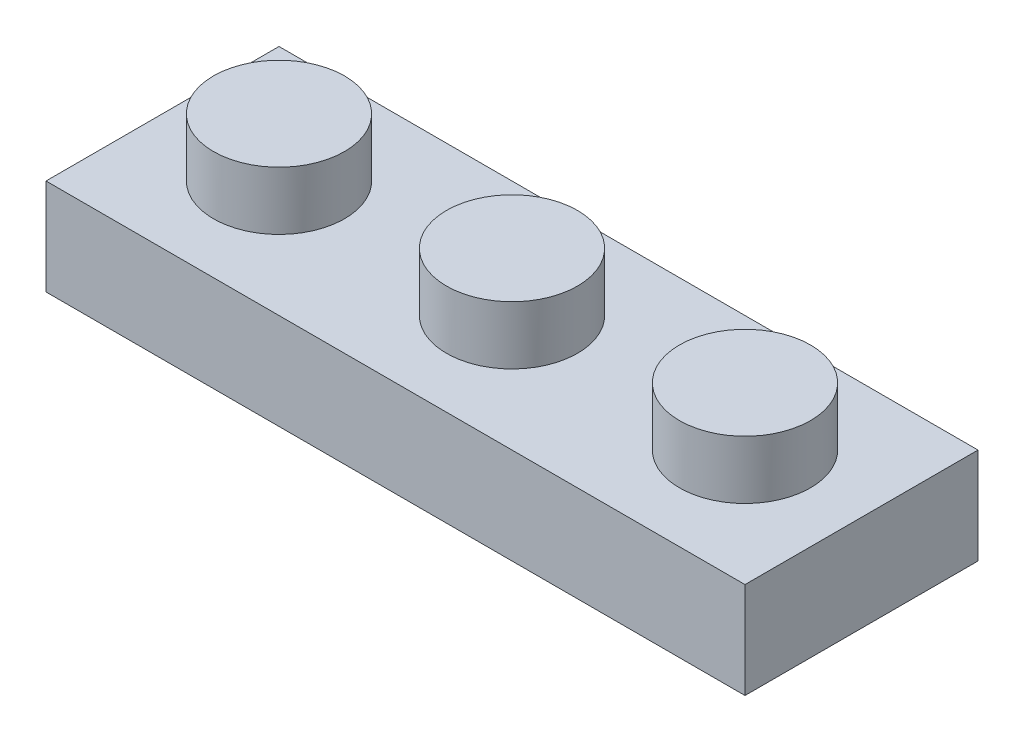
ISO-10303-21;
HEADER;
FILE_DESCRIPTION(('STEP AP214'),'2;1');
FILE_NAME('part.step','',(''),(''),'','','');
FILE_SCHEMA(('AUTOMOTIVE_DESIGN { 1 0 10303 214 1 1 1 1 }'));
ENDSEC;
DATA;
#1=APPLICATION_CONTEXT('core data for automotive mechanical design processes');
#2=APPLICATION_PROTOCOL_DEFINITION('international standard','automotive_design',2000,#1);
#3=PRODUCT_CONTEXT('',#1,'mechanical');
#4=PRODUCT('Part','Part','',(#3));
#5=PRODUCT_RELATED_PRODUCT_CATEGORY('part','',(#4));
#6=PRODUCT_DEFINITION_FORMATION('','',#4);
#7=PRODUCT_DEFINITION_CONTEXT('part definition',#1,'design');
#8=PRODUCT_DEFINITION('design','',#6,#7);
#9=PRODUCT_DEFINITION_SHAPE('','',#8);
#10=(LENGTH_UNIT() NAMED_UNIT(*) SI_UNIT(.MILLI.,.METRE.));
#11=(NAMED_UNIT(*) PLANE_ANGLE_UNIT() SI_UNIT($,.RADIAN.));
#12=(NAMED_UNIT(*) SI_UNIT($,.STERADIAN.) SOLID_ANGLE_UNIT());
#13=UNCERTAINTY_MEASURE_WITH_UNIT(LENGTH_MEASURE(1.E-05),#10,'distance_accuracy_value','');
#14=(GEOMETRIC_REPRESENTATION_CONTEXT(3) GLOBAL_UNCERTAINTY_ASSIGNED_CONTEXT((#13)) GLOBAL_UNIT_ASSIGNED_CONTEXT((#10,
#11,#12)) REPRESENTATION_CONTEXT('',''));
#15=CARTESIAN_POINT('',(0.,0.,0.));
#16=DIRECTION('',(0.,0.,1.));
#17=DIRECTION('',(1.,0.,0.));
#18=AXIS2_PLACEMENT_3D('',#15,#16,#17);
#19=CARTESIAN_POINT('',(0.,3.3,-8.));
#20=DIRECTION('',(0.,-1.,0.));
#21=DIRECTION('',(0.,0.,-1.));
#22=AXIS2_PLACEMENT_3D('',#19,#20,#21);
#23=PLANE('',#22);
#24=CARTESIAN_POINT('',(12.,3.3,-4.));
#25=DIRECTION('',(0.,-1.,0.));
#26=DIRECTION('',(0.,0.,-1.));
#27=AXIS2_PLACEMENT_3D('',#24,#25,#26);
#28=CIRCLE('',#27,2.25);
#29=CARTESIAN_POINT('',(12.,3.3,-6.25));
#30=VERTEX_POINT('',#29);
#31=EDGE_CURVE('E40',#30,#30,#28,.F.);
#32=ORIENTED_EDGE('',*,*,#31,.F.);
#33=EDGE_LOOP('',(#32));
#34=FACE_BOUND('',#33,.T.);
#35=DIRECTION('',(0.,0.,1.));
#36=VECTOR('',#35,1.);
#37=CARTESIAN_POINT('',(0.,3.3,0.));
#38=LINE('',#37,#36);
#39=CARTESIAN_POINT('',(0.,3.3,-8.));
#40=VERTEX_POINT('',#39);
#41=CARTESIAN_POINT('',(0.,3.3,0.));
#42=VERTEX_POINT('',#41);
#43=EDGE_CURVE('E250',#40,#42,#38,.T.);
#44=ORIENTED_EDGE('',*,*,#43,.T.);
#45=DIRECTION('',(1.,0.,0.));
#46=VECTOR('',#45,1.);
#47=CARTESIAN_POINT('',(0.,3.3,0.));
#48=LINE('',#47,#46);
#49=CARTESIAN_POINT('',(24.,3.3,0.));
#50=VERTEX_POINT('',#49);
#51=EDGE_CURVE('E253',#42,#50,#48,.T.);
#52=ORIENTED_EDGE('',*,*,#51,.T.);
#53=DIRECTION('',(0.,0.,-1.));
#54=VECTOR('',#53,1.);
#55=CARTESIAN_POINT('',(24.,3.3,0.));
#56=LINE('',#55,#54);
#57=CARTESIAN_POINT('',(24.,3.3,-8.));
#58=VERTEX_POINT('',#57);
#59=EDGE_CURVE('E256',#50,#58,#56,.T.);
#60=ORIENTED_EDGE('',*,*,#59,.T.);
#61=DIRECTION('',(-1.,0.,0.));
#62=VECTOR('',#61,1.);
#63=CARTESIAN_POINT('',(0.,3.3,-8.));
#64=LINE('',#63,#62);
#65=EDGE_CURVE('E258',#58,#40,#64,.T.);
#66=ORIENTED_EDGE('',*,*,#65,.T.);
#67=EDGE_LOOP('',(#44,#52,#60,#66));
#68=FACE_BOUND('',#67,.T.);
#69=CARTESIAN_POINT('',(4.,3.3,-4.));
#70=DIRECTION('',(0.,-1.,0.));
#71=DIRECTION('',(0.,0.,-1.));
#72=AXIS2_PLACEMENT_3D('',#69,#70,#71);
#73=CIRCLE('',#72,2.25);
#74=CARTESIAN_POINT('',(4.,3.3,-6.25));
#75=VERTEX_POINT('',#74);
#76=EDGE_CURVE('E279',#75,#75,#73,.F.);
#77=ORIENTED_EDGE('',*,*,#76,.F.);
#78=EDGE_LOOP('',(#77));
#79=FACE_BOUND('',#78,.T.);
#80=CARTESIAN_POINT('',(20.,3.3,-4.));
#81=DIRECTION('',(0.,-1.,0.));
#82=DIRECTION('',(0.,0.,-1.));
#83=AXIS2_PLACEMENT_3D('',#80,#81,#82);
#84=CIRCLE('',#83,2.25);
#85=CARTESIAN_POINT('',(20.,3.3,-6.25));
#86=VERTEX_POINT('',#85);
#87=EDGE_CURVE('E11',#86,#86,#84,.F.);
#88=ORIENTED_EDGE('',*,*,#87,.F.);
#89=EDGE_LOOP('',(#88));
#90=FACE_BOUND('',#89,.T.);
#91=ADVANCED_FACE('F32',(#34,#68,#79,#90),#23,.F.);
#92=CARTESIAN_POINT('',(0.,3.3,0.));
#93=DIRECTION('',(1.,0.,0.));
#94=DIRECTION('',(0.,0.,-1.));
#95=AXIS2_PLACEMENT_3D('',#92,#93,#94);
#96=PLANE('',#95);
#97=DIRECTION('',(0.,0.,1.));
#98=VECTOR('',#97,1.);
#99=CARTESIAN_POINT('',(0.,0.,0.));
#100=LINE('',#99,#98);
#101=CARTESIAN_POINT('',(0.,0.,-8.));
#102=VERTEX_POINT('',#101);
#103=CARTESIAN_POINT('',(0.,0.,0.));
#104=VERTEX_POINT('',#103);
#105=EDGE_CURVE('E249',#102,#104,#100,.T.);
#106=ORIENTED_EDGE('',*,*,#105,.T.);
#107=DIRECTION('',(0.,-1.,0.));
#108=VECTOR('',#107,1.);
#109=CARTESIAN_POINT('',(0.,3.3,0.));
#110=LINE('',#109,#108);
#111=EDGE_CURVE('E276',#42,#104,#110,.T.);
#112=ORIENTED_EDGE('',*,*,#111,.F.);
#113=ORIENTED_EDGE('',*,*,#43,.F.);
#114=DIRECTION('',(0.,-1.,0.));
#115=VECTOR('',#114,1.);
#116=CARTESIAN_POINT('',(0.,3.3,-8.));
#117=LINE('',#116,#115);
#118=EDGE_CURVE('E260',#40,#102,#117,.T.);
#119=ORIENTED_EDGE('',*,*,#118,.T.);
#120=EDGE_LOOP('',(#106,#112,#113,#119));
#121=FACE_BOUND('',#120,.T.);
#122=ADVANCED_FACE('F34',(#121),#96,.F.);
#123=CARTESIAN_POINT('',(0.,3.3,0.));
#124=DIRECTION('',(0.,0.,-1.));
#125=DIRECTION('',(-1.,0.,0.));
#126=AXIS2_PLACEMENT_3D('',#123,#124,#125);
#127=PLANE('',#126);
#128=DIRECTION('',(1.,0.,0.));
#129=VECTOR('',#128,1.);
#130=CARTESIAN_POINT('',(0.,0.,0.));
#131=LINE('',#130,#129);
#132=CARTESIAN_POINT('',(24.,0.,0.));
#133=VERTEX_POINT('',#132);
#134=EDGE_CURVE('E263',#104,#133,#131,.T.);
#135=ORIENTED_EDGE('',*,*,#134,.T.);
#136=DIRECTION('',(0.,-1.,0.));
#137=VECTOR('',#136,1.);
#138=CARTESIAN_POINT('',(24.,3.3,0.));
#139=LINE('',#138,#137);
#140=EDGE_CURVE('E273',#50,#133,#139,.T.);
#141=ORIENTED_EDGE('',*,*,#140,.F.);
#142=ORIENTED_EDGE('',*,*,#51,.F.);
#143=ORIENTED_EDGE('',*,*,#111,.T.);
#144=EDGE_LOOP('',(#135,#141,#142,#143));
#145=FACE_BOUND('',#144,.T.);
#146=ADVANCED_FACE('F385',(#145),#127,.F.);
#147=CARTESIAN_POINT('',(24.,3.3,0.));
#148=DIRECTION('',(-1.,0.,0.));
#149=DIRECTION('',(0.,0.,1.));
#150=AXIS2_PLACEMENT_3D('',#147,#148,#149);
#151=PLANE('',#150);
#152=DIRECTION('',(0.,0.,-1.));
#153=VECTOR('',#152,1.);
#154=CARTESIAN_POINT('',(24.,0.,0.));
#155=LINE('',#154,#153);
#156=CARTESIAN_POINT('',(24.,0.,-8.));
#157=VERTEX_POINT('',#156);
#158=EDGE_CURVE('E265',#133,#157,#155,.T.);
#159=ORIENTED_EDGE('',*,*,#158,.T.);
#160=DIRECTION('',(0.,-1.,0.));
#161=VECTOR('',#160,1.);
#162=CARTESIAN_POINT('',(24.,3.3,-8.));
#163=LINE('',#162,#161);
#164=EDGE_CURVE('E270',#58,#157,#163,.T.);
#165=ORIENTED_EDGE('',*,*,#164,.F.);
#166=ORIENTED_EDGE('',*,*,#59,.F.);
#167=ORIENTED_EDGE('',*,*,#140,.T.);
#168=EDGE_LOOP('',(#159,#165,#166,#167));
#169=FACE_BOUND('',#168,.T.);
#170=ADVANCED_FACE('F382',(#169),#151,.F.);
#171=CARTESIAN_POINT('',(0.,3.3,-8.));
#172=DIRECTION('',(0.,0.,1.));
#173=DIRECTION('',(1.,0.,0.));
#174=AXIS2_PLACEMENT_3D('',#171,#172,#173);
#175=PLANE('',#174);
#176=DIRECTION('',(-1.,0.,0.));
#177=VECTOR('',#176,1.);
#178=CARTESIAN_POINT('',(0.,0.,-8.));
#179=LINE('',#178,#177);
#180=EDGE_CURVE('E254',#157,#102,#179,.T.);
#181=ORIENTED_EDGE('',*,*,#180,.T.);
#182=ORIENTED_EDGE('',*,*,#118,.F.);
#183=ORIENTED_EDGE('',*,*,#65,.F.);
#184=ORIENTED_EDGE('',*,*,#164,.T.);
#185=EDGE_LOOP('',(#181,#182,#183,#184));
#186=FACE_BOUND('',#185,.T.);
#187=ADVANCED_FACE('F363',(#186),#175,.F.);
#188=CARTESIAN_POINT('',(0.,0.,-8.));
#189=DIRECTION('',(0.,-1.,0.));
#190=DIRECTION('',(0.,0.,-1.));
#191=AXIS2_PLACEMENT_3D('',#188,#189,#190);
#192=PLANE('',#191);
#193=DIRECTION('',(0.,0.,-1.));
#194=VECTOR('',#193,1.);
#195=CARTESIAN_POINT('',(1.75,0.,-1.75));
#196=LINE('',#195,#194);
#197=CARTESIAN_POINT('',(1.75,0.,-1.75));
#198=VERTEX_POINT('',#197);
#199=CARTESIAN_POINT('',(1.74999999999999,0.,-6.25));
#200=VERTEX_POINT('',#199);
#201=EDGE_CURVE('E47',#198,#200,#196,.T.);
#202=ORIENTED_EDGE('',*,*,#201,.F.);
#203=DIRECTION('',(-1.,0.,0.));
#204=VECTOR('',#203,1.);
#205=CARTESIAN_POINT('',(1.75,0.,-1.75));
#206=LINE('',#205,#204);
#207=CARTESIAN_POINT('',(6.25,0.,-1.75));
#208=VERTEX_POINT('',#207);
#209=EDGE_CURVE('E177',#208,#198,#206,.T.);
#210=ORIENTED_EDGE('',*,*,#209,.F.);
#211=DIRECTION('',(0.,0.,1.));
#212=VECTOR('',#211,1.);
#213=CARTESIAN_POINT('',(6.25,0.,-1.75));
#214=LINE('',#213,#212);
#215=CARTESIAN_POINT('',(6.25,0.,-6.25));
#216=VERTEX_POINT('',#215);
#217=EDGE_CURVE('E168',#216,#208,#214,.T.);
#218=ORIENTED_EDGE('',*,*,#217,.F.);
#219=DIRECTION('',(1.,0.,0.));
#220=VECTOR('',#219,1.);
#221=CARTESIAN_POINT('',(1.74999999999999,0.,-6.25));
#222=LINE('',#221,#220);
#223=EDGE_CURVE('E156',#200,#216,#222,.T.);
#224=ORIENTED_EDGE('',*,*,#223,.F.);
#225=EDGE_LOOP('',(#202,#210,#218,#224));
#226=FACE_BOUND('',#225,.T.);
#227=DIRECTION('',(0.,0.,-1.));
#228=VECTOR('',#227,1.);
#229=CARTESIAN_POINT('',(9.75,0.,-1.75));
#230=LINE('',#229,#228);
#231=CARTESIAN_POINT('',(9.75,0.,-1.75));
#232=VERTEX_POINT('',#231);
#233=CARTESIAN_POINT('',(9.74999999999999,0.,-6.25));
#234=VERTEX_POINT('',#233);
#235=EDGE_CURVE('E55',#232,#234,#230,.T.);
#236=ORIENTED_EDGE('',*,*,#235,.F.);
#237=DIRECTION('',(-1.,0.,0.));
#238=VECTOR('',#237,1.);
#239=CARTESIAN_POINT('',(9.75,0.,-1.75));
#240=LINE('',#239,#238);
#241=CARTESIAN_POINT('',(14.25,0.,-1.75));
#242=VERTEX_POINT('',#241);
#243=EDGE_CURVE('E203',#242,#232,#240,.T.);
#244=ORIENTED_EDGE('',*,*,#243,.F.);
#245=DIRECTION('',(0.,0.,1.));
#246=VECTOR('',#245,1.);
#247=CARTESIAN_POINT('',(14.25,0.,-1.75));
#248=LINE('',#247,#246);
#249=CARTESIAN_POINT('',(14.25,0.,-6.25));
#250=VERTEX_POINT('',#249);
#251=EDGE_CURVE('E198',#250,#242,#248,.T.);
#252=ORIENTED_EDGE('',*,*,#251,.F.);
#253=DIRECTION('',(1.,0.,0.));
#254=VECTOR('',#253,1.);
#255=CARTESIAN_POINT('',(9.74999999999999,0.,-6.25));
#256=LINE('',#255,#254);
#257=EDGE_CURVE('E182',#234,#250,#256,.T.);
#258=ORIENTED_EDGE('',*,*,#257,.F.);
#259=EDGE_LOOP('',(#236,#244,#252,#258));
#260=FACE_BOUND('',#259,.T.);
#261=DIRECTION('',(0.,0.,-1.));
#262=VECTOR('',#261,1.);
#263=CARTESIAN_POINT('',(17.75,0.,-1.75));
#264=LINE('',#263,#262);
#265=CARTESIAN_POINT('',(17.75,0.,-1.75));
#266=VERTEX_POINT('',#265);
#267=CARTESIAN_POINT('',(17.75,0.,-6.25));
#268=VERTEX_POINT('',#267);
#269=EDGE_CURVE('E214',#266,#268,#264,.T.);
#270=ORIENTED_EDGE('',*,*,#269,.F.);
#271=DIRECTION('',(-1.,0.,0.));
#272=VECTOR('',#271,1.);
#273=CARTESIAN_POINT('',(17.75,0.,-1.75));
#274=LINE('',#273,#272);
#275=CARTESIAN_POINT('',(22.25,0.,-1.75));
#276=VERTEX_POINT('',#275);
#277=EDGE_CURVE('E219',#276,#266,#274,.T.);
#278=ORIENTED_EDGE('',*,*,#277,.F.);
#279=DIRECTION('',(0.,0.,1.));
#280=VECTOR('',#279,1.);
#281=CARTESIAN_POINT('',(22.25,0.,-1.75));
#282=LINE('',#281,#280);
#283=CARTESIAN_POINT('',(22.25,0.,-6.25));
#284=VERTEX_POINT('',#283);
#285=EDGE_CURVE('E233',#284,#276,#282,.T.);
#286=ORIENTED_EDGE('',*,*,#285,.F.);
#287=DIRECTION('',(1.,0.,0.));
#288=VECTOR('',#287,1.);
#289=CARTESIAN_POINT('',(17.75,0.,-6.25));
#290=LINE('',#289,#288);
#291=EDGE_CURVE('E230',#268,#284,#290,.T.);
#292=ORIENTED_EDGE('',*,*,#291,.F.);
#293=EDGE_LOOP('',(#270,#278,#286,#292));
#294=FACE_BOUND('',#293,.T.);
#295=ORIENTED_EDGE('',*,*,#105,.F.);
#296=ORIENTED_EDGE('',*,*,#180,.F.);
#297=ORIENTED_EDGE('',*,*,#158,.F.);
#298=ORIENTED_EDGE('',*,*,#134,.F.);
#299=EDGE_LOOP('',(#295,#296,#297,#298));
#300=FACE_BOUND('',#299,.T.);
#301=ADVANCED_FACE('F357',(#226,#260,#294,#300),#192,.T.);
#302=CARTESIAN_POINT('',(4.,5.3,-4.));
#303=DIRECTION('',(0.,-1.,0.));
#304=DIRECTION('',(0.,0.,-1.));
#305=AXIS2_PLACEMENT_3D('',#302,#303,#304);
#306=CYLINDRICAL_SURFACE('',#305,2.25);
#307=CARTESIAN_POINT('',(4.,5.3,-4.));
#308=DIRECTION('',(0.,1.,0.));
#309=DIRECTION('',(0.,0.,1.));
#310=AXIS2_PLACEMENT_3D('',#307,#308,#309);
#311=CIRCLE('',#310,2.25);
#312=CARTESIAN_POINT('',(4.,5.3,-1.75));
#313=VERTEX_POINT('',#312);
#314=EDGE_CURVE('E240',#313,#313,#311,.T.);
#315=ORIENTED_EDGE('',*,*,#314,.F.);
#316=EDGE_LOOP('',(#315));
#317=FACE_BOUND('',#316,.T.);
#318=ORIENTED_EDGE('',*,*,#76,.T.);
#319=EDGE_LOOP('',(#318));
#320=FACE_BOUND('',#319,.T.);
#321=ADVANCED_FACE('F362',(#317,#320),#306,.T.);
#322=CARTESIAN_POINT('',(4.,5.3,-4.));
#323=DIRECTION('',(0.,1.,0.));
#324=DIRECTION('',(0.,0.,1.));
#325=AXIS2_PLACEMENT_3D('',#322,#323,#324);
#326=PLANE('',#325);
#327=ORIENTED_EDGE('',*,*,#314,.T.);
#328=EDGE_LOOP('',(#327));
#329=FACE_BOUND('',#328,.T.);
#330=ADVANCED_FACE('F397',(#329),#326,.T.);
#331=CARTESIAN_POINT('',(17.75,2.5,-1.75));
#332=DIRECTION('',(-1.,0.,0.));
#333=DIRECTION('',(0.,0.,1.));
#334=AXIS2_PLACEMENT_3D('',#331,#332,#333);
#335=PLANE('',#334);
#336=ORIENTED_EDGE('',*,*,#269,.T.);
#337=DIRECTION('',(0.,-1.,0.));
#338=VECTOR('',#337,1.);
#339=CARTESIAN_POINT('',(17.75,2.5,-6.25));
#340=LINE('',#339,#338);
#341=CARTESIAN_POINT('',(17.75,2.5,-6.25));
#342=VERTEX_POINT('',#341);
#343=EDGE_CURVE('E228',#342,#268,#340,.T.);
#344=ORIENTED_EDGE('',*,*,#343,.F.);
#345=DIRECTION('',(0.,0.,-1.));
#346=VECTOR('',#345,1.);
#347=CARTESIAN_POINT('',(17.75,2.5,-1.75));
#348=LINE('',#347,#346);
#349=CARTESIAN_POINT('',(17.75,2.5,-1.75));
#350=VERTEX_POINT('',#349);
#351=EDGE_CURVE('E215',#350,#342,#348,.T.);
#352=ORIENTED_EDGE('',*,*,#351,.F.);
#353=DIRECTION('',(0.,-1.,0.));
#354=VECTOR('',#353,1.);
#355=CARTESIAN_POINT('',(17.75,2.5,-1.75));
#356=LINE('',#355,#354);
#357=EDGE_CURVE('E238',#350,#266,#356,.T.);
#358=ORIENTED_EDGE('',*,*,#357,.T.);
#359=EDGE_LOOP('',(#336,#344,#352,#358));
#360=FACE_BOUND('',#359,.T.);
#361=ADVANCED_FACE('F401',(#360),#335,.F.);
#362=CARTESIAN_POINT('',(17.75,2.5,-1.75));
#363=DIRECTION('',(0.,0.,1.));
#364=DIRECTION('',(1.,0.,0.));
#365=AXIS2_PLACEMENT_3D('',#362,#363,#364);
#366=PLANE('',#365);
#367=ORIENTED_EDGE('',*,*,#277,.T.);
#368=ORIENTED_EDGE('',*,*,#357,.F.);
#369=DIRECTION('',(-1.,0.,0.));
#370=VECTOR('',#369,1.);
#371=CARTESIAN_POINT('',(17.75,2.5,-1.75));
#372=LINE('',#371,#370);
#373=CARTESIAN_POINT('',(22.25,2.5,-1.75));
#374=VERTEX_POINT('',#373);
#375=EDGE_CURVE('E225',#374,#350,#372,.T.);
#376=ORIENTED_EDGE('',*,*,#375,.F.);
#377=DIRECTION('',(0.,-1.,0.));
#378=VECTOR('',#377,1.);
#379=CARTESIAN_POINT('',(22.25,2.5,-1.75));
#380=LINE('',#379,#378);
#381=EDGE_CURVE('E241',#374,#276,#380,.T.);
#382=ORIENTED_EDGE('',*,*,#381,.T.);
#383=EDGE_LOOP('',(#367,#368,#376,#382));
#384=FACE_BOUND('',#383,.T.);
#385=ADVANCED_FACE('F405',(#384),#366,.F.);
#386=CARTESIAN_POINT('',(22.25,2.5,-1.75));
#387=DIRECTION('',(1.,0.,0.));
#388=DIRECTION('',(0.,0.,-1.));
#389=AXIS2_PLACEMENT_3D('',#386,#387,#388);
#390=PLANE('',#389);
#391=ORIENTED_EDGE('',*,*,#285,.T.);
#392=ORIENTED_EDGE('',*,*,#381,.F.);
#393=DIRECTION('',(0.,0.,1.));
#394=VECTOR('',#393,1.);
#395=CARTESIAN_POINT('',(22.25,2.5,-1.75));
#396=LINE('',#395,#394);
#397=CARTESIAN_POINT('',(22.25,2.5,-6.25));
#398=VERTEX_POINT('',#397);
#399=EDGE_CURVE('E222',#398,#374,#396,.T.);
#400=ORIENTED_EDGE('',*,*,#399,.F.);
#401=DIRECTION('',(0.,-1.,0.));
#402=VECTOR('',#401,1.);
#403=CARTESIAN_POINT('',(22.25,2.5,-6.25));
#404=LINE('',#403,#402);
#405=EDGE_CURVE('E243',#398,#284,#404,.T.);
#406=ORIENTED_EDGE('',*,*,#405,.T.);
#407=EDGE_LOOP('',(#391,#392,#400,#406));
#408=FACE_BOUND('',#407,.T.);
#409=ADVANCED_FACE('F410',(#408),#390,.F.);
#410=CARTESIAN_POINT('',(17.75,2.5,-6.25));
#411=DIRECTION('',(0.,0.,-1.));
#412=DIRECTION('',(-1.,0.,0.));
#413=AXIS2_PLACEMENT_3D('',#410,#411,#412);
#414=PLANE('',#413);
#415=ORIENTED_EDGE('',*,*,#291,.T.);
#416=ORIENTED_EDGE('',*,*,#405,.F.);
#417=DIRECTION('',(1.,0.,0.));
#418=VECTOR('',#417,1.);
#419=CARTESIAN_POINT('',(17.75,2.5,-6.25));
#420=LINE('',#419,#418);
#421=EDGE_CURVE('E218',#342,#398,#420,.T.);
#422=ORIENTED_EDGE('',*,*,#421,.F.);
#423=ORIENTED_EDGE('',*,*,#343,.T.);
#424=EDGE_LOOP('',(#415,#416,#422,#423));
#425=FACE_BOUND('',#424,.T.);
#426=ADVANCED_FACE('F407',(#425),#414,.F.);
#427=CARTESIAN_POINT('',(17.75,2.5,-6.25));
#428=DIRECTION('',(0.,-1.,0.));
#429=DIRECTION('',(0.,0.,-1.));
#430=AXIS2_PLACEMENT_3D('',#427,#428,#429);
#431=PLANE('',#430);
#432=ORIENTED_EDGE('',*,*,#351,.T.);
#433=ORIENTED_EDGE('',*,*,#421,.T.);
#434=ORIENTED_EDGE('',*,*,#399,.T.);
#435=ORIENTED_EDGE('',*,*,#375,.T.);
#436=EDGE_LOOP('',(#432,#433,#434,#435));
#437=FACE_BOUND('',#436,.T.);
#438=ADVANCED_FACE('F312',(#437),#431,.T.);
#439=CARTESIAN_POINT('',(12.,5.3,-4.));
#440=DIRECTION('',(0.,-1.,0.));
#441=DIRECTION('',(0.,0.,-1.));
#442=AXIS2_PLACEMENT_3D('',#439,#440,#441);
#443=CYLINDRICAL_SURFACE('',#442,2.25);
#444=CARTESIAN_POINT('',(12.,5.3,-4.));
#445=DIRECTION('',(0.,1.,0.));
#446=DIRECTION('',(0.,0.,1.));
#447=AXIS2_PLACEMENT_3D('',#444,#445,#446);
#448=CIRCLE('',#447,2.25);
#449=CARTESIAN_POINT('',(12.,5.3,-1.75));
#450=VERTEX_POINT('',#449);
#451=EDGE_CURVE('E211',#450,#450,#448,.T.);
#452=ORIENTED_EDGE('',*,*,#451,.F.);
#453=EDGE_LOOP('',(#452));
#454=FACE_BOUND('',#453,.T.);
#455=ORIENTED_EDGE('',*,*,#31,.T.);
#456=EDGE_LOOP('',(#455));
#457=FACE_BOUND('',#456,.T.);
#458=ADVANCED_FACE('F284',(#454,#457),#443,.T.);
#459=CARTESIAN_POINT('',(12.,5.3,-4.));
#460=DIRECTION('',(0.,1.,0.));
#461=DIRECTION('',(0.,0.,1.));
#462=AXIS2_PLACEMENT_3D('',#459,#460,#461);
#463=PLANE('',#462);
#464=ORIENTED_EDGE('',*,*,#451,.T.);
#465=EDGE_LOOP('',(#464));
#466=FACE_BOUND('',#465,.T.);
#467=ADVANCED_FACE('F299',(#466),#463,.T.);
#468=CARTESIAN_POINT('',(20.,5.3,-4.));
#469=DIRECTION('',(0.,-1.,0.));
#470=DIRECTION('',(0.,0.,-1.));
#471=AXIS2_PLACEMENT_3D('',#468,#469,#470);
#472=CYLINDRICAL_SURFACE('',#471,2.25);
#473=CARTESIAN_POINT('',(20.,5.3,-4.));
#474=DIRECTION('',(0.,1.,0.));
#475=DIRECTION('',(0.,0.,1.));
#476=AXIS2_PLACEMENT_3D('',#473,#474,#475);
#477=CIRCLE('',#476,2.25);
#478=CARTESIAN_POINT('',(20.,5.3,-1.75));
#479=VERTEX_POINT('',#478);
#480=EDGE_CURVE('E208',#479,#479,#477,.T.);
#481=ORIENTED_EDGE('',*,*,#480,.F.);
#482=EDGE_LOOP('',(#481));
#483=FACE_BOUND('',#482,.T.);
#484=ORIENTED_EDGE('',*,*,#87,.T.);
#485=EDGE_LOOP('',(#484));
#486=FACE_BOUND('',#485,.T.);
#487=ADVANCED_FACE('F296',(#483,#486),#472,.T.);
#488=CARTESIAN_POINT('',(20.,5.3,-4.));
#489=DIRECTION('',(0.,1.,0.));
#490=DIRECTION('',(0.,0.,1.));
#491=AXIS2_PLACEMENT_3D('',#488,#489,#490);
#492=PLANE('',#491);
#493=ORIENTED_EDGE('',*,*,#480,.T.);
#494=EDGE_LOOP('',(#493));
#495=FACE_BOUND('',#494,.T.);
#496=ADVANCED_FACE('F298',(#495),#492,.T.);
#497=CARTESIAN_POINT('',(9.75,2.5,-1.75));
#498=DIRECTION('',(-1.,0.,0.));
#499=DIRECTION('',(0.,0.,1.));
#500=AXIS2_PLACEMENT_3D('',#497,#498,#499);
#501=PLANE('',#500);
#502=ORIENTED_EDGE('',*,*,#235,.T.);
#503=DIRECTION('',(0.,-1.,0.));
#504=VECTOR('',#503,1.);
#505=CARTESIAN_POINT('',(9.74999999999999,2.5,-6.25));
#506=LINE('',#505,#504);
#507=CARTESIAN_POINT('',(9.74999999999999,2.5,-6.25));
#508=VERTEX_POINT('',#507);
#509=EDGE_CURVE('E196',#508,#234,#506,.T.);
#510=ORIENTED_EDGE('',*,*,#509,.F.);
#511=DIRECTION('',(0.,0.,-1.));
#512=VECTOR('',#511,1.);
#513=CARTESIAN_POINT('',(9.75,2.5,-1.75));
#514=LINE('',#513,#512);
#515=CARTESIAN_POINT('',(9.75,2.5,-1.75));
#516=VERTEX_POINT('',#515);
#517=EDGE_CURVE('E184',#516,#508,#514,.T.);
#518=ORIENTED_EDGE('',*,*,#517,.F.);
#519=DIRECTION('',(0.,-1.,0.));
#520=VECTOR('',#519,1.);
#521=CARTESIAN_POINT('',(9.75,2.5,-1.75));
#522=LINE('',#521,#520);
#523=EDGE_CURVE('E205',#516,#232,#522,.T.);
#524=ORIENTED_EDGE('',*,*,#523,.T.);
#525=EDGE_LOOP('',(#502,#510,#518,#524));
#526=FACE_BOUND('',#525,.T.);
#527=ADVANCED_FACE('F307',(#526),#501,.F.);
#528=CARTESIAN_POINT('',(9.75,2.5,-1.75));
#529=DIRECTION('',(0.,0.,1.));
#530=DIRECTION('',(1.,0.,0.));
#531=AXIS2_PLACEMENT_3D('',#528,#529,#530);
#532=PLANE('',#531);
#533=ORIENTED_EDGE('',*,*,#243,.T.);
#534=ORIENTED_EDGE('',*,*,#523,.F.);
#535=DIRECTION('',(-1.,0.,0.));
#536=VECTOR('',#535,1.);
#537=CARTESIAN_POINT('',(9.75,2.5,-1.75));
#538=LINE('',#537,#536);
#539=CARTESIAN_POINT('',(14.25,2.5,-1.75));
#540=VERTEX_POINT('',#539);
#541=EDGE_CURVE('E190',#540,#516,#538,.T.);
#542=ORIENTED_EDGE('',*,*,#541,.F.);
#543=DIRECTION('',(0.,-1.,0.));
#544=VECTOR('',#543,1.);
#545=CARTESIAN_POINT('',(14.25,2.5,-1.75));
#546=LINE('',#545,#544);
#547=EDGE_CURVE('E200',#540,#242,#546,.T.);
#548=ORIENTED_EDGE('',*,*,#547,.T.);
#549=EDGE_LOOP('',(#533,#534,#542,#548));
#550=FACE_BOUND('',#549,.T.);
#551=ADVANCED_FACE('F331',(#550),#532,.F.);
#552=CARTESIAN_POINT('',(14.25,2.5,-1.75));
#553=DIRECTION('',(1.,0.,0.));
#554=DIRECTION('',(0.,0.,-1.));
#555=AXIS2_PLACEMENT_3D('',#552,#553,#554);
#556=PLANE('',#555);
#557=ORIENTED_EDGE('',*,*,#251,.T.);
#558=ORIENTED_EDGE('',*,*,#547,.F.);
#559=DIRECTION('',(0.,0.,1.));
#560=VECTOR('',#559,1.);
#561=CARTESIAN_POINT('',(14.25,2.5,-1.75));
#562=LINE('',#561,#560);
#563=CARTESIAN_POINT('',(14.25,2.5,-6.25));
#564=VERTEX_POINT('',#563);
#565=EDGE_CURVE('E188',#564,#540,#562,.T.);
#566=ORIENTED_EDGE('',*,*,#565,.F.);
#567=DIRECTION('',(0.,-1.,0.));
#568=VECTOR('',#567,1.);
#569=CARTESIAN_POINT('',(14.25,2.5,-6.25));
#570=LINE('',#569,#568);
#571=EDGE_CURVE('E193',#564,#250,#570,.T.);
#572=ORIENTED_EDGE('',*,*,#571,.T.);
#573=EDGE_LOOP('',(#557,#558,#566,#572));
#574=FACE_BOUND('',#573,.T.);
#575=ADVANCED_FACE('F324',(#574),#556,.F.);
#576=CARTESIAN_POINT('',(9.74999999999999,2.5,-6.25));
#577=DIRECTION('',(0.,0.,-1.));
#578=DIRECTION('',(-1.,0.,0.));
#579=AXIS2_PLACEMENT_3D('',#576,#577,#578);
#580=PLANE('',#579);
#581=ORIENTED_EDGE('',*,*,#257,.T.);
#582=ORIENTED_EDGE('',*,*,#571,.F.);
#583=DIRECTION('',(1.,0.,0.));
#584=VECTOR('',#583,1.);
#585=CARTESIAN_POINT('',(9.74999999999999,2.5,-6.25));
#586=LINE('',#585,#584);
#587=EDGE_CURVE('E186',#508,#564,#586,.T.);
#588=ORIENTED_EDGE('',*,*,#587,.F.);
#589=ORIENTED_EDGE('',*,*,#509,.T.);
#590=EDGE_LOOP('',(#581,#582,#588,#589));
#591=FACE_BOUND('',#590,.T.);
#592=ADVANCED_FACE('F315',(#591),#580,.F.);
#593=CARTESIAN_POINT('',(9.74999999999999,2.5,-6.25));
#594=DIRECTION('',(0.,-1.,0.));
#595=DIRECTION('',(0.,0.,-1.));
#596=AXIS2_PLACEMENT_3D('',#593,#594,#595);
#597=PLANE('',#596);
#598=ORIENTED_EDGE('',*,*,#517,.T.);
#599=ORIENTED_EDGE('',*,*,#587,.T.);
#600=ORIENTED_EDGE('',*,*,#565,.T.);
#601=ORIENTED_EDGE('',*,*,#541,.T.);
#602=EDGE_LOOP('',(#598,#599,#600,#601));
#603=FACE_BOUND('',#602,.T.);
#604=ADVANCED_FACE('F302',(#603),#597,.T.);
#605=CARTESIAN_POINT('',(1.75,2.5,-1.75));
#606=DIRECTION('',(-1.,0.,0.));
#607=DIRECTION('',(0.,0.,1.));
#608=AXIS2_PLACEMENT_3D('',#605,#606,#607);
#609=PLANE('',#608);
#610=ORIENTED_EDGE('',*,*,#201,.T.);
#611=DIRECTION('',(0.,-1.,0.));
#612=VECTOR('',#611,1.);
#613=CARTESIAN_POINT('',(1.74999999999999,2.5,-6.25));
#614=LINE('',#613,#612);
#615=CARTESIAN_POINT('',(1.74999999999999,2.5,-6.25));
#616=VERTEX_POINT('',#615);
#617=EDGE_CURVE('E161',#616,#200,#614,.T.);
#618=ORIENTED_EDGE('',*,*,#617,.F.);
#619=DIRECTION('',(0.,0.,-1.));
#620=VECTOR('',#619,1.);
#621=CARTESIAN_POINT('',(1.75,2.5,-1.75));
#622=LINE('',#621,#620);
#623=CARTESIAN_POINT('',(1.75,2.5,-1.75));
#624=VERTEX_POINT('',#623);
#625=EDGE_CURVE('E148',#624,#616,#622,.T.);
#626=ORIENTED_EDGE('',*,*,#625,.F.);
#627=DIRECTION('',(0.,-1.,0.));
#628=VECTOR('',#627,1.);
#629=CARTESIAN_POINT('',(1.75,2.5,-1.75));
#630=LINE('',#629,#628);
#631=EDGE_CURVE('E179',#624,#198,#630,.T.);
#632=ORIENTED_EDGE('',*,*,#631,.T.);
#633=EDGE_LOOP('',(#610,#618,#626,#632));
#634=FACE_BOUND('',#633,.T.);
#635=ADVANCED_FACE('F167',(#634),#609,.F.);
#636=CARTESIAN_POINT('',(1.75,2.5,-1.75));
#637=DIRECTION('',(0.,0.,1.));
#638=DIRECTION('',(1.,0.,0.));
#639=AXIS2_PLACEMENT_3D('',#636,#637,#638);
#640=PLANE('',#639);
#641=ORIENTED_EDGE('',*,*,#209,.T.);
#642=ORIENTED_EDGE('',*,*,#631,.F.);
#643=DIRECTION('',(-1.,0.,0.));
#644=VECTOR('',#643,1.);
#645=CARTESIAN_POINT('',(1.75,2.5,-1.75));
#646=LINE('',#645,#644);
#647=CARTESIAN_POINT('',(6.25,2.5,-1.75));
#648=VERTEX_POINT('',#647);
#649=EDGE_CURVE('E154',#648,#624,#646,.T.);
#650=ORIENTED_EDGE('',*,*,#649,.F.);
#651=DIRECTION('',(0.,-1.,0.));
#652=VECTOR('',#651,1.);
#653=CARTESIAN_POINT('',(6.25,2.5,-1.75));
#654=LINE('',#653,#652);
#655=EDGE_CURVE('E170',#648,#208,#654,.T.);
#656=ORIENTED_EDGE('',*,*,#655,.T.);
#657=EDGE_LOOP('',(#641,#642,#650,#656));
#658=FACE_BOUND('',#657,.T.);
#659=ADVANCED_FACE('F322',(#658),#640,.F.);
#660=CARTESIAN_POINT('',(6.25,2.5,-1.75));
#661=DIRECTION('',(1.,0.,0.));
#662=DIRECTION('',(0.,0.,-1.));
#663=AXIS2_PLACEMENT_3D('',#660,#661,#662);
#664=PLANE('',#663);
#665=ORIENTED_EDGE('',*,*,#217,.T.);
#666=ORIENTED_EDGE('',*,*,#655,.F.);
#667=DIRECTION('',(0.,0.,1.));
#668=VECTOR('',#667,1.);
#669=CARTESIAN_POINT('',(6.25,2.5,-1.75));
#670=LINE('',#669,#668);
#671=CARTESIAN_POINT('',(6.25,2.5,-6.25));
#672=VERTEX_POINT('',#671);
#673=EDGE_CURVE('E165',#672,#648,#670,.T.);
#674=ORIENTED_EDGE('',*,*,#673,.F.);
#675=DIRECTION('',(0.,-1.,0.));
#676=VECTOR('',#675,1.);
#677=CARTESIAN_POINT('',(6.25,2.5,-6.25));
#678=LINE('',#677,#676);
#679=EDGE_CURVE('E164',#672,#216,#678,.T.);
#680=ORIENTED_EDGE('',*,*,#679,.T.);
#681=EDGE_LOOP('',(#665,#666,#674,#680));
#682=FACE_BOUND('',#681,.T.);
#683=ADVANCED_FACE('F344',(#682),#664,.F.);
#684=CARTESIAN_POINT('',(1.74999999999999,2.5,-6.25));
#685=DIRECTION('',(0.,0.,-1.));
#686=DIRECTION('',(-1.,0.,0.));
#687=AXIS2_PLACEMENT_3D('',#684,#685,#686);
#688=PLANE('',#687);
#689=ORIENTED_EDGE('',*,*,#223,.T.);
#690=ORIENTED_EDGE('',*,*,#679,.F.);
#691=DIRECTION('',(1.,0.,0.));
#692=VECTOR('',#691,1.);
#693=CARTESIAN_POINT('',(1.74999999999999,2.5,-6.25));
#694=LINE('',#693,#692);
#695=EDGE_CURVE('E151',#616,#672,#694,.T.);
#696=ORIENTED_EDGE('',*,*,#695,.F.);
#697=ORIENTED_EDGE('',*,*,#617,.T.);
#698=EDGE_LOOP('',(#689,#690,#696,#697));
#699=FACE_BOUND('',#698,.T.);
#700=ADVANCED_FACE('F160',(#699),#688,.F.);
#701=CARTESIAN_POINT('',(1.74999999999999,2.5,-6.25));
#702=DIRECTION('',(0.,-1.,0.));
#703=DIRECTION('',(0.,0.,-1.));
#704=AXIS2_PLACEMENT_3D('',#701,#702,#703);
#705=PLANE('',#704);
#706=ORIENTED_EDGE('',*,*,#625,.T.);
#707=ORIENTED_EDGE('',*,*,#695,.T.);
#708=ORIENTED_EDGE('',*,*,#673,.T.);
#709=ORIENTED_EDGE('',*,*,#649,.T.);
#710=EDGE_LOOP('',(#706,#707,#708,#709));
#711=FACE_BOUND('',#710,.T.);
#712=ADVANCED_FACE('F150',(#711),#705,.T.);
#713=CLOSED_SHELL('',(#91,#122,#146,#170,#187,#301,#321,#330,#361,#385,#409,#426,#438,#458,#467,
#487,#496,#527,#551,#575,#592,#604,#635,#659,#683,#700,#712));
#714=MANIFOLD_SOLID_BREP('B2',#713);
#715=ADVANCED_BREP_SHAPE_REPRESENTATION('',(#18,#714),#14);
#716=SHAPE_DEFINITION_REPRESENTATION(#9,#715);
ENDSEC;
END-ISO-10303-21;
